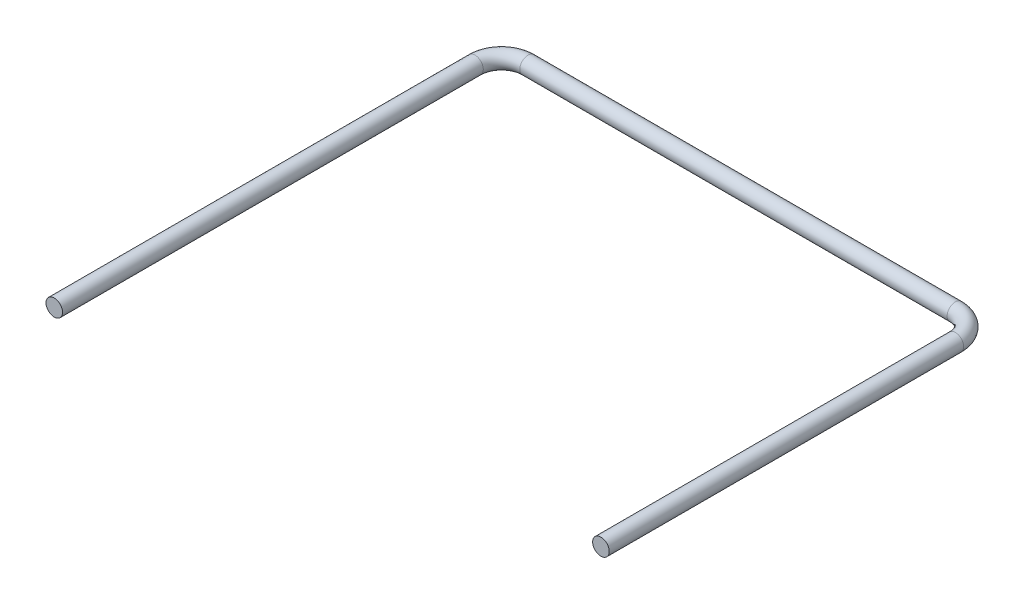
from build123d import *

# Parameters (mm, degrees)
SKETCH2_R = 0.79375


with BuildPart() as part:
    # Sweep1: sweep along a curve in space
    with BuildLine() as sweep1_path:
        Line((-42.350050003, 0, 2.857991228), (-42.350050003, 0, -37.464508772))
        ThreePointArc((-42.350050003, 0, -37.464508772), (-41.606101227, 0, -39.260559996), (-39.810050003, 0, -40.004508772))
        Line((-39.810050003, 0, -40.004508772), (1.147449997, 0, -40.004508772))
        ThreePointArc((1.147449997, 0, -40.004508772), (2.943501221, 0, -39.260559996), (3.687449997, 0, -37.464508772))
        Line((3.687449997, 0, -37.464508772), (3.687449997, 0, -3.492008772))
    # Sketch2 → Sweep1 (sweep)
    with BuildSketch(Plane(origin=(-42.350050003, 0, 2.857991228), x_dir=(-1, 0, 0), z_dir=(0, 0, -1))):
        with Locations((0.001944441, 0)):
            Circle(SKETCH2_R)
    sweep(path=sweep1_path.line)


solid = part.part
